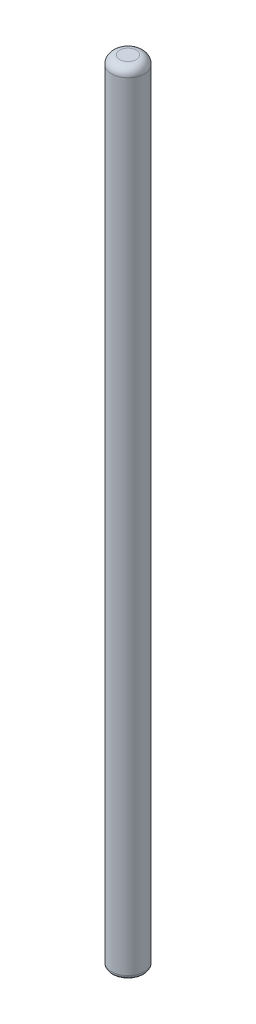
ISO-10303-21;
HEADER;
FILE_DESCRIPTION(('STEP AP214'),'2;1');
FILE_NAME('part.step','',(''),(''),'','','');
FILE_SCHEMA(('AUTOMOTIVE_DESIGN { 1 0 10303 214 1 1 1 1 }'));
ENDSEC;
DATA;
#1=APPLICATION_CONTEXT('core data for automotive mechanical design processes');
#2=APPLICATION_PROTOCOL_DEFINITION('international standard','automotive_design',2000,#1);
#3=PRODUCT_CONTEXT('',#1,'mechanical');
#4=PRODUCT('Part','Part','',(#3));
#5=PRODUCT_RELATED_PRODUCT_CATEGORY('part','',(#4));
#6=PRODUCT_DEFINITION_FORMATION('','',#4);
#7=PRODUCT_DEFINITION_CONTEXT('part definition',#1,'design');
#8=PRODUCT_DEFINITION('design','',#6,#7);
#9=PRODUCT_DEFINITION_SHAPE('','',#8);
#10=(LENGTH_UNIT() NAMED_UNIT(*) SI_UNIT(.MILLI.,.METRE.));
#11=(NAMED_UNIT(*) PLANE_ANGLE_UNIT() SI_UNIT($,.RADIAN.));
#12=(NAMED_UNIT(*) SI_UNIT($,.STERADIAN.) SOLID_ANGLE_UNIT());
#13=UNCERTAINTY_MEASURE_WITH_UNIT(LENGTH_MEASURE(1.E-05),#10,'distance_accuracy_value','');
#14=(GEOMETRIC_REPRESENTATION_CONTEXT(3) GLOBAL_UNCERTAINTY_ASSIGNED_CONTEXT((#13)) GLOBAL_UNIT_ASSIGNED_CONTEXT((#10,
#11,#12)) REPRESENTATION_CONTEXT('',''));
#15=CARTESIAN_POINT('',(0.,0.,0.));
#16=DIRECTION('',(0.,0.,1.));
#17=DIRECTION('',(1.,0.,0.));
#18=AXIS2_PLACEMENT_3D('',#15,#16,#17);
#19=CARTESIAN_POINT('',(0.,304.8,0.));
#20=DIRECTION('',(0.,-1.,0.));
#21=DIRECTION('',(0.,0.,-1.));
#22=AXIS2_PLACEMENT_3D('',#19,#20,#21);
#23=CYLINDRICAL_SURFACE('',#22,6.35);
#24=CARTESIAN_POINT('',(0.,1.58749999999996,0.));
#25=DIRECTION('',(0.,1.,0.));
#26=DIRECTION('',(0.,0.,1.));
#27=AXIS2_PLACEMENT_3D('',#24,#25,#26);
#28=CIRCLE('',#27,6.35);
#29=CARTESIAN_POINT('',(0.,1.58749999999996,-6.35));
#30=VERTEX_POINT('',#29);
#31=EDGE_CURVE('E44',#30,#30,#28,.T.);
#32=CARTESIAN_POINT('',(0.,301.625,0.));
#33=DIRECTION('',(0.,1.,0.));
#34=DIRECTION('',(0.,0.,1.));
#35=AXIS2_PLACEMENT_3D('',#32,#33,#34);
#36=CIRCLE('',#35,6.35);
#37=CARTESIAN_POINT('',(0.,301.625,-6.35));
#38=VERTEX_POINT('',#37);
#39=EDGE_CURVE('E48',#38,#38,#36,.F.);
#40=CARTESIAN_POINT('',(0.,1.58749999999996,-6.35));
#41=CARTESIAN_POINT('',(0.,4.71289062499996,-6.35));
#42=CARTESIAN_POINT('',(0.,7.83828124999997,-6.35));
#43=CARTESIAN_POINT('',(0.,14.0890625,-6.35));
#44=CARTESIAN_POINT('',(0.,17.214453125,-6.35));
#45=CARTESIAN_POINT('',(0.,23.465234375,-6.35));
#46=CARTESIAN_POINT('',(0.,26.590625,-6.35));
#47=CARTESIAN_POINT('',(0.,32.84140625,-6.35));
#48=CARTESIAN_POINT('',(0.,35.966796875,-6.35));
#49=CARTESIAN_POINT('',(0.,42.217578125,-6.35));
#50=CARTESIAN_POINT('',(0.,45.34296875,-6.35));
#51=CARTESIAN_POINT('',(0.,51.59375,-6.35));
#52=CARTESIAN_POINT('',(0.,54.719140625,-6.35));
#53=CARTESIAN_POINT('',(0.,60.9699218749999,-6.35));
#54=CARTESIAN_POINT('',(0.,64.0953124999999,-6.35));
#55=CARTESIAN_POINT('',(0.,70.34609375,-6.35));
#56=CARTESIAN_POINT('',(0.,73.4714843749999,-6.35));
#57=CARTESIAN_POINT('',(0.,79.7222656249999,-6.35));
#58=CARTESIAN_POINT('',(0.,82.84765625,-6.35));
#59=CARTESIAN_POINT('',(0.,89.0984375,-6.35));
#60=CARTESIAN_POINT('',(0.,92.223828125,-6.35));
#61=CARTESIAN_POINT('',(0.,98.474609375,-6.35));
#62=CARTESIAN_POINT('',(0.,101.6,-6.35));
#63=CARTESIAN_POINT('',(0.,107.85078125,-6.35));
#64=CARTESIAN_POINT('',(0.,110.976171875,-6.35));
#65=CARTESIAN_POINT('',(0.,117.226953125,-6.35));
#66=CARTESIAN_POINT('',(0.,120.35234375,-6.35));
#67=CARTESIAN_POINT('',(0.,126.603125,-6.35));
#68=CARTESIAN_POINT('',(0.,129.728515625,-6.35));
#69=CARTESIAN_POINT('',(0.,135.979296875,-6.35));
#70=CARTESIAN_POINT('',(0.,139.1046875,-6.35));
#71=CARTESIAN_POINT('',(0.,145.35546875,-6.35));
#72=CARTESIAN_POINT('',(0.,148.480859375,-6.35));
#73=CARTESIAN_POINT('',(0.,154.731640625,-6.35));
#74=CARTESIAN_POINT('',(0.,157.85703125,-6.35));
#75=CARTESIAN_POINT('',(0.,164.1078125,-6.35));
#76=CARTESIAN_POINT('',(0.,167.233203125,-6.35));
#77=CARTESIAN_POINT('',(0.,173.483984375,-6.35));
#78=CARTESIAN_POINT('',(0.,176.609375,-6.35));
#79=CARTESIAN_POINT('',(0.,182.86015625,-6.35));
#80=CARTESIAN_POINT('',(0.,185.985546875,-6.35));
#81=CARTESIAN_POINT('',(0.,192.236328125,-6.35));
#82=CARTESIAN_POINT('',(0.,195.36171875,-6.35));
#83=CARTESIAN_POINT('',(0.,201.6125,-6.35));
#84=CARTESIAN_POINT('',(0.,204.737890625,-6.35));
#85=CARTESIAN_POINT('',(0.,210.988671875,-6.35));
#86=CARTESIAN_POINT('',(0.,214.1140625,-6.35));
#87=CARTESIAN_POINT('',(0.,220.36484375,-6.35));
#88=CARTESIAN_POINT('',(0.,223.490234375,-6.35));
#89=CARTESIAN_POINT('',(0.,229.741015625,-6.35));
#90=CARTESIAN_POINT('',(0.,232.86640625,-6.35));
#91=CARTESIAN_POINT('',(0.,239.1171875,-6.35));
#92=CARTESIAN_POINT('',(0.,242.242578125,-6.35));
#93=CARTESIAN_POINT('',(0.,248.493359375,-6.35));
#94=CARTESIAN_POINT('',(0.,251.61875,-6.35));
#95=CARTESIAN_POINT('',(0.,257.86953125,-6.35));
#96=CARTESIAN_POINT('',(0.,260.994921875,-6.35));
#97=CARTESIAN_POINT('',(0.,267.245703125,-6.35));
#98=CARTESIAN_POINT('',(0.,270.37109375,-6.35));
#99=CARTESIAN_POINT('',(0.,276.621875,-6.35));
#100=CARTESIAN_POINT('',(0.,279.747265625,-6.35));
#101=CARTESIAN_POINT('',(0.,285.998046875,-6.35));
#102=CARTESIAN_POINT('',(0.,289.1234375,-6.35));
#103=CARTESIAN_POINT('',(0.,295.37421875,-6.35));
#104=CARTESIAN_POINT('',(0.,298.499609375,-6.35));
#105=CARTESIAN_POINT('',(0.,301.625,-6.35));
#106=B_SPLINE_CURVE_WITH_KNOTS('',3,(#40,#41,#42,#43,#44,#45,#46,#47,#48,#49,#50,#51,#52,#53,
#54,#55,#56,#57,#58,#59,#60,#61,#62,#63,#64,#65,#66,#67,#68,#69,#70,#71,#72,#73,#74,#75,#76,#77,
#78,#79,#80,#81,#82,#83,#84,#85,#86,#87,#88,#89,#90,#91,#92,#93,#94,#95,#96,#97,#98,#99,#100,
#101,#102,#103,#104,#105),.UNSPECIFIED.,.F.,.F.,(4,2,2,2,2,2,2,2,2,2,2,2,2,2,2,2,2,2,2,2,2,2,2,
2,2,2,2,2,2,2,2,2,4),(0.,9.37617187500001,18.75234375,28.128515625,37.5046875,46.880859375,
56.25703125,65.633203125,75.009375,84.385546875,93.76171875,103.137890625,112.5140625,
121.890234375,131.26640625,140.642578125,150.01875,159.394921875,168.77109375,178.147265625,
187.5234375,196.899609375,206.27578125,215.651953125,225.028125,234.404296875,243.78046875,
253.156640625,262.5328125,271.908984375,281.28515625,290.661328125,300.0375),.UNSPECIFIED.);
#107=EDGE_CURVE('BSEAM33',#30,#38,#106,.T.);
#108=ORIENTED_EDGE('',*,*,#31,.T.);
#109=ORIENTED_EDGE('',*,*,#39,.T.);
#110=ORIENTED_EDGE('',*,*,#107,.T.);
#111=ORIENTED_EDGE('',*,*,#107,.F.);
#112=EDGE_LOOP('',(#108,#110,#109,#111));
#113=FACE_BOUND('',#112,.T.);
#114=ADVANCED_FACE('F33',(#113),#23,.T.);
#115=CARTESIAN_POINT('',(0.,304.8,0.));
#116=DIRECTION('',(0.,1.,0.));
#117=DIRECTION('',(0.,0.,1.));
#118=AXIS2_PLACEMENT_3D('',#115,#116,#117);
#119=PLANE('',#118);
#120=CARTESIAN_POINT('',(0.,304.8,0.));
#121=DIRECTION('',(0.,1.,0.));
#122=DIRECTION('',(0.,0.,1.));
#123=AXIS2_PLACEMENT_3D('',#120,#121,#122);
#124=CIRCLE('',#123,3.175);
#125=CARTESIAN_POINT('',(0.,304.8,3.175));
#126=VERTEX_POINT('',#125);
#127=EDGE_CURVE('E11',#126,#126,#124,.T.);
#128=ORIENTED_EDGE('',*,*,#127,.T.);
#129=EDGE_LOOP('',(#128));
#130=FACE_BOUND('',#129,.T.);
#131=ADVANCED_FACE('F64',(#130),#119,.T.);
#132=CARTESIAN_POINT('',(0.,0.,0.));
#133=DIRECTION('',(0.,1.,0.));
#134=DIRECTION('',(0.,0.,1.));
#135=AXIS2_PLACEMENT_3D('',#132,#133,#134);
#136=PLANE('',#135);
#137=CARTESIAN_POINT('',(0.,0.,0.));
#138=DIRECTION('',(0.,1.,0.));
#139=DIRECTION('',(0.,0.,1.));
#140=AXIS2_PLACEMENT_3D('',#137,#138,#139);
#141=CIRCLE('',#140,4.7625);
#142=CARTESIAN_POINT('',(0.,0.,4.7625));
#143=VERTEX_POINT('',#142);
#144=EDGE_CURVE('E40',#143,#143,#141,.F.);
#145=ORIENTED_EDGE('',*,*,#144,.T.);
#146=EDGE_LOOP('',(#145));
#147=FACE_BOUND('',#146,.T.);
#148=ADVANCED_FACE('F61',(#147),#136,.F.);
#149=CARTESIAN_POINT('',(0.,1.58750000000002,0.));
#150=DIRECTION('',(0.,1.,0.));
#151=DIRECTION('',(0.,0.,1.));
#152=AXIS2_PLACEMENT_3D('',#149,#150,#151);
#153=TOROIDAL_SURFACE('',#152,4.7625,1.5875);
#154=ORIENTED_EDGE('',*,*,#144,.F.);
#155=EDGE_LOOP('',(#154));
#156=FACE_BOUND('',#155,.T.);
#157=ORIENTED_EDGE('',*,*,#31,.F.);
#158=EDGE_LOOP('',(#157));
#159=FACE_BOUND('',#158,.T.);
#160=ADVANCED_FACE('F57',(#156,#159),#153,.T.);
#161=CARTESIAN_POINT('',(0.,301.625,0.));
#162=DIRECTION('',(0.,1.,0.));
#163=DIRECTION('',(0.,0.,1.));
#164=AXIS2_PLACEMENT_3D('',#161,#162,#163);
#165=DEGENERATE_TOROIDAL_SURFACE('',#164,3.175,3.175,.T.);
#166=ORIENTED_EDGE('',*,*,#39,.F.);
#167=EDGE_LOOP('',(#166));
#168=FACE_BOUND('',#167,.T.);
#169=ORIENTED_EDGE('',*,*,#127,.F.);
#170=EDGE_LOOP('',(#169));
#171=FACE_BOUND('',#170,.T.);
#172=ADVANCED_FACE('F35',(#168,#171),#165,.T.);
#173=CLOSED_SHELL('',(#114,#131,#148,#160,#172));
#174=MANIFOLD_SOLID_BREP('B2',#173);
#175=ADVANCED_BREP_SHAPE_REPRESENTATION('',(#18,#174),#14);
#176=SHAPE_DEFINITION_REPRESENTATION(#9,#175);
ENDSEC;
END-ISO-10303-21;
